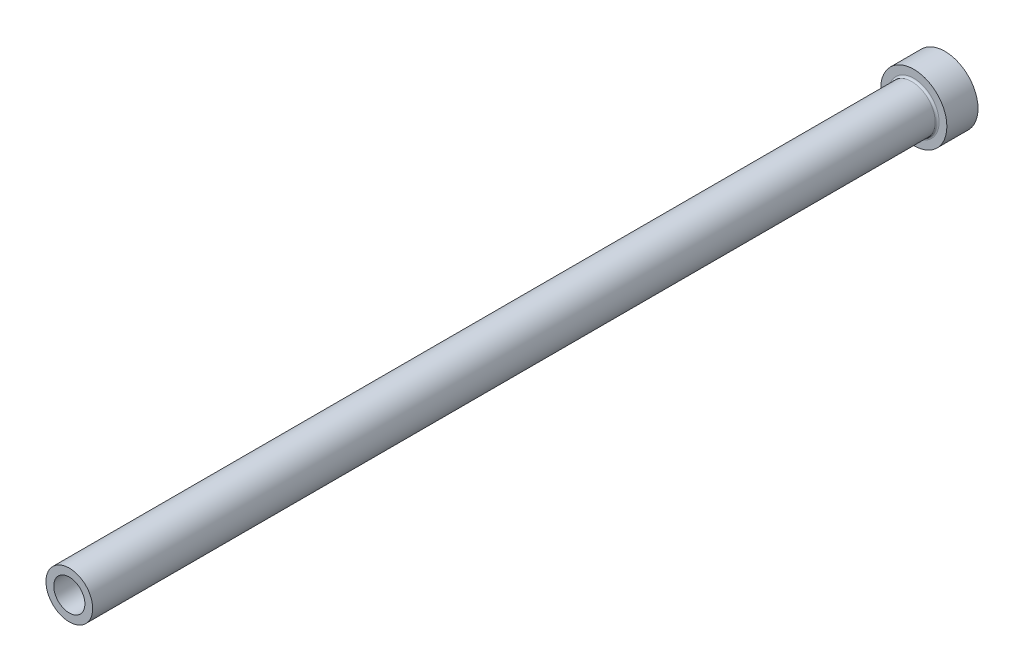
from build123d import *

# Parameters (mm, degrees)
HEAD_FILLET_R          = 0.5
ID_RELIEF_CHAMFER_SIZE = 0.5


with BuildPart() as part:
    # OD FV → Base Revolve (revolve)
    with BuildSketch(Plane(origin=(0, 0, 0), x_dir=(1, 0, 0), z_dir=(0, 1, 0))):
        Polygon((0, -225), (6, -225), (6, -8), (8.5, -8), (8.5, 0), (0, 0), align=None)
    revolve(axis=Axis((0, 0, 225), (0, 0, -1)))

    # ID FV → Hole (revolve, cut)
    with BuildSketch(Plane(origin=(0, 0, 0), x_dir=(1, 0, 0), z_dir=(0, 1, 0))):
        Polygon((0, -225), (4, -225), (4, -125), (4.25, -124.566987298), (4.25, 0), (0, 0), align=None)
    revolve(axis=Axis((0, 0, 225), (0, 0, -1)), mode=Mode.SUBTRACT)

    # Head Fillet
    head_fillet_edges = [part.edges().sort_by_distance(p)[0] for p in [
        (-6, 0, 8),
    ]]
    fillet(head_fillet_edges, radius=HEAD_FILLET_R)

    # ID Relief Chamfer
    id_relief_chamfer_edges = [part.edges().sort_by_distance(p)[0] for p in [
        (-4.25, 0, 0),
    ]]
    chamfer(id_relief_chamfer_edges, length=ID_RELIEF_CHAMFER_SIZE)


solid = part.part
